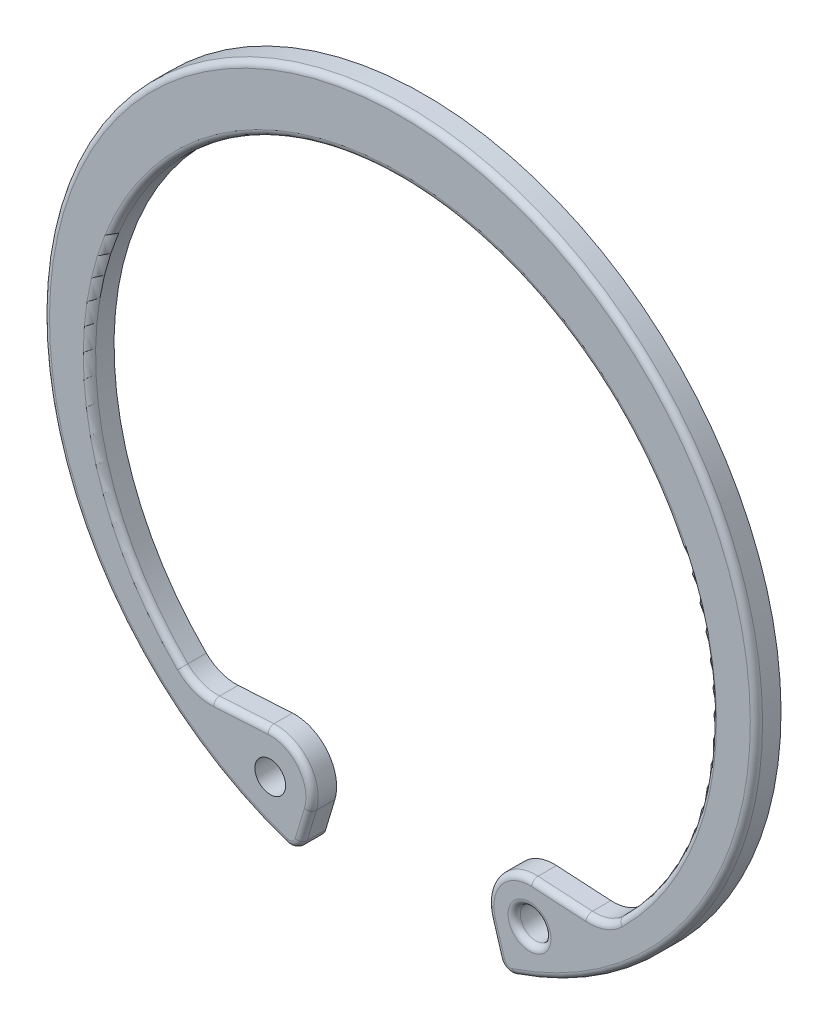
ISO-10303-21;
HEADER;
FILE_DESCRIPTION(('STEP AP214'),'2;1');
FILE_NAME('part.step','',(''),(''),'','','');
FILE_SCHEMA(('AUTOMOTIVE_DESIGN { 1 0 10303 214 1 1 1 1 }'));
ENDSEC;
DATA;
#1=APPLICATION_CONTEXT('core data for automotive mechanical design processes');
#2=APPLICATION_PROTOCOL_DEFINITION('international standard','automotive_design',2000,#1);
#3=PRODUCT_CONTEXT('',#1,'mechanical');
#4=PRODUCT('Part','Part','',(#3));
#5=PRODUCT_RELATED_PRODUCT_CATEGORY('part','',(#4));
#6=PRODUCT_DEFINITION_FORMATION('','',#4);
#7=PRODUCT_DEFINITION_CONTEXT('part definition',#1,'design');
#8=PRODUCT_DEFINITION('design','',#6,#7);
#9=PRODUCT_DEFINITION_SHAPE('','',#8);
#10=(LENGTH_UNIT() NAMED_UNIT(*) SI_UNIT(.MILLI.,.METRE.));
#11=(NAMED_UNIT(*) PLANE_ANGLE_UNIT() SI_UNIT($,.RADIAN.));
#12=(NAMED_UNIT(*) SI_UNIT($,.STERADIAN.) SOLID_ANGLE_UNIT());
#13=UNCERTAINTY_MEASURE_WITH_UNIT(LENGTH_MEASURE(1.E-05),#10,'distance_accuracy_value','');
#14=(GEOMETRIC_REPRESENTATION_CONTEXT(3) GLOBAL_UNCERTAINTY_ASSIGNED_CONTEXT((#13)) GLOBAL_UNIT_ASSIGNED_CONTEXT((#10,
#11,#12)) REPRESENTATION_CONTEXT('',''));
#15=CARTESIAN_POINT('',(0.,0.,0.));
#16=DIRECTION('',(0.,0.,1.));
#17=DIRECTION('',(1.,0.,0.));
#18=AXIS2_PLACEMENT_3D('',#15,#16,#17);
#19=CARTESIAN_POINT('',(0.,0.,2.));
#20=DIRECTION('',(0.,0.,1.));
#21=DIRECTION('',(1.,0.,0.));
#22=AXIS2_PLACEMENT_3D('',#19,#20,#21);
#23=PLANE('',#22);
#24=CARTESIAN_POINT('',(10.5436447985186,-23.3279136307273,2.));
#25=DIRECTION('',(0.,0.,1.));
#26=DIRECTION('',(1.,0.,0.));
#27=AXIS2_PLACEMENT_3D('',#24,#25,#26);
#28=CIRCLE('',#27,1.75);
#29=CARTESIAN_POINT('',(12.2936447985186,-23.3279136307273,2.));
#30=VERTEX_POINT('',#29);
#31=EDGE_CURVE('E253',#30,#30,#28,.F.);
#32=ORIENTED_EDGE('',*,*,#31,.T.);
#33=EDGE_LOOP('',(#32));
#34=FACE_BOUND('',#33,.T.);
#35=DIRECTION('',(0.287187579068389,-0.957874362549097,0.));
#36=VECTOR('',#35,1.);
#37=CARTESIAN_POINT('',(8.5150594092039,-26.6597780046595,2.));
#38=LINE('',#37,#36);
#39=CARTESIAN_POINT('',(7.76580914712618,-24.1607576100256,2.));
#40=VERTEX_POINT('',#39);
#41=CARTESIAN_POINT('',(8.5150594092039,-26.6597780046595,2.));
#42=VERTEX_POINT('',#41);
#43=EDGE_CURVE('E248',#40,#42,#38,.T.);
#44=ORIENTED_EDGE('',*,*,#43,.T.);
#45=CARTESIAN_POINT('',(8.99399659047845,-26.5161842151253,2.));
#46=DIRECTION('',(0.,0.,1.));
#47=DIRECTION('',(1.,0.,0.));
#48=AXIS2_PLACEMENT_3D('',#45,#46,#47);
#49=CIRCLE('',#48,0.5);
#50=CARTESIAN_POINT('',(9.15460367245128,-26.9896875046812,2.));
#51=VERTEX_POINT('',#50);
#52=EDGE_CURVE('E250',#42,#51,#49,.T.);
#53=ORIENTED_EDGE('',*,*,#52,.T.);
#54=CARTESIAN_POINT('',(0.,0.,2.));
#55=DIRECTION('',(0.,0.,1.));
#56=DIRECTION('',(1.,0.,0.));
#57=AXIS2_PLACEMENT_3D('',#54,#55,#56);
#58=CIRCLE('',#57,28.5);
#59=CARTESIAN_POINT('',(-9.15460367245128,-26.9896875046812,2.));
#60=VERTEX_POINT('',#59);
#61=EDGE_CURVE('E228',#51,#60,#58,.T.);
#62=ORIENTED_EDGE('',*,*,#61,.T.);
#63=CARTESIAN_POINT('',(-8.99399659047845,-26.5161842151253,2.));
#64=DIRECTION('',(0.,0.,1.));
#65=DIRECTION('',(1.,0.,0.));
#66=AXIS2_PLACEMENT_3D('',#63,#64,#65);
#67=CIRCLE('',#66,0.5);
#68=CARTESIAN_POINT('',(-8.5150594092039,-26.6597780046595,2.));
#69=VERTEX_POINT('',#68);
#70=EDGE_CURVE('E230',#60,#69,#67,.T.);
#71=ORIENTED_EDGE('',*,*,#70,.T.);
#72=DIRECTION('',(0.287187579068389,0.957874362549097,0.));
#73=VECTOR('',#72,1.);
#74=CARTESIAN_POINT('',(-7.76580914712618,-24.1607576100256,2.));
#75=LINE('',#74,#73);
#76=CARTESIAN_POINT('',(-7.76580914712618,-24.1607576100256,2.));
#77=VERTEX_POINT('',#76);
#78=EDGE_CURVE('E232',#69,#77,#75,.T.);
#79=ORIENTED_EDGE('',*,*,#78,.T.);
#80=CARTESIAN_POINT('',(-10.5436447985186,-23.3279136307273,2.));
#81=DIRECTION('',(0.,0.,1.));
#82=DIRECTION('',(1.,0.,0.));
#83=AXIS2_PLACEMENT_3D('',#80,#81,#82);
#84=CIRCLE('',#83,2.9);
#85=CARTESIAN_POINT('',(-10.7111032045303,-20.4327525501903,2.));
#86=VERTEX_POINT('',#85);
#87=EDGE_CURVE('E234',#77,#86,#84,.T.);
#88=ORIENTED_EDGE('',*,*,#87,.T.);
#89=DIRECTION('',(-0.998331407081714,-0.0577442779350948,0.));
#90=VECTOR('',#89,1.);
#91=CARTESIAN_POINT('',(-15.1299326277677,-20.6883411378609,2.));
#92=LINE('',#91,#90);
#93=CARTESIAN_POINT('',(-15.1299326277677,-20.6883411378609,2.));
#94=VERTEX_POINT('',#93);
#95=EDGE_CURVE('E236',#86,#94,#92,.T.);
#96=ORIENTED_EDGE('',*,*,#95,.T.);
#97=CARTESIAN_POINT('',(-15.3551353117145,-16.7948486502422,2.));
#98=DIRECTION('',(0.,0.,1.));
#99=DIRECTION('',(1.,0.,0.));
#100=AXIS2_PLACEMENT_3D('',#97,#98,#99);
#101=CIRCLE('',#100,3.89999999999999);
#102=CARTESIAN_POINT('',(-18.0958688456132,-19.5694440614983,2.));
#103=VERTEX_POINT('',#102);
#104=EDGE_CURVE('E238',#94,#103,#101,.F.);
#105=ORIENTED_EDGE('',*,*,#104,.T.);
#106=CARTESIAN_POINT('',(0.,-1.25,2.));
#107=DIRECTION('',(0.,0.,1.));
#108=DIRECTION('',(1.,0.,0.));
#109=AXIS2_PLACEMENT_3D('',#106,#107,#108);
#110=CIRCLE('',#109,25.75);
#111=CARTESIAN_POINT('',(18.0958688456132,-19.5694440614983,2.));
#112=VERTEX_POINT('',#111);
#113=EDGE_CURVE('E240',#103,#112,#110,.F.);
#114=ORIENTED_EDGE('',*,*,#113,.T.);
#115=CARTESIAN_POINT('',(15.3551353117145,-16.7948486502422,2.));
#116=DIRECTION('',(0.,0.,1.));
#117=DIRECTION('',(1.,0.,0.));
#118=AXIS2_PLACEMENT_3D('',#115,#116,#117);
#119=CIRCLE('',#118,3.89999999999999);
#120=CARTESIAN_POINT('',(15.1299326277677,-20.6883411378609,2.));
#121=VERTEX_POINT('',#120);
#122=EDGE_CURVE('E242',#112,#121,#119,.F.);
#123=ORIENTED_EDGE('',*,*,#122,.T.);
#124=DIRECTION('',(-0.998331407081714,0.0577442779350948,0.));
#125=VECTOR('',#124,1.);
#126=CARTESIAN_POINT('',(10.7111032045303,-20.4327525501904,2.));
#127=LINE('',#126,#125);
#128=CARTESIAN_POINT('',(10.7111032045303,-20.4327525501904,2.));
#129=VERTEX_POINT('',#128);
#130=EDGE_CURVE('E244',#121,#129,#127,.T.);
#131=ORIENTED_EDGE('',*,*,#130,.T.);
#132=CARTESIAN_POINT('',(10.5436447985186,-23.3279136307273,2.));
#133=DIRECTION('',(0.,0.,1.));
#134=DIRECTION('',(1.,0.,0.));
#135=AXIS2_PLACEMENT_3D('',#132,#133,#134);
#136=CIRCLE('',#135,2.9);
#137=EDGE_CURVE('E246',#129,#40,#136,.T.);
#138=ORIENTED_EDGE('',*,*,#137,.T.);
#139=EDGE_LOOP('',(#44,#53,#62,#71,#79,#88,#96,#105,#114,#123,#131,#138));
#140=FACE_BOUND('',#139,.T.);
#141=CARTESIAN_POINT('',(-10.5436447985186,-23.3279136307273,2.));
#142=DIRECTION('',(0.,0.,1.));
#143=DIRECTION('',(-1.,0.,0.));
#144=AXIS2_PLACEMENT_3D('',#141,#142,#143);
#145=CIRCLE('',#144,1.25);
#146=CARTESIAN_POINT('',(-11.7936447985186,-23.3279136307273,2.));
#147=VERTEX_POINT('',#146);
#148=EDGE_CURVE('E390',#147,#147,#145,.T.);
#149=ORIENTED_EDGE('',*,*,#148,.F.);
#150=EDGE_LOOP('',(#149));
#151=FACE_BOUND('',#150,.T.);
#152=ADVANCED_FACE('F30',(#34,#140,#151),#23,.T.);
#153=CARTESIAN_POINT('',(0.,0.,0.));
#154=DIRECTION('',(0.,0.,1.));
#155=DIRECTION('',(1.,0.,0.));
#156=AXIS2_PLACEMENT_3D('',#153,#154,#155);
#157=PLANE('',#156);
#158=CARTESIAN_POINT('',(10.5436447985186,-23.3279136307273,0.));
#159=DIRECTION('',(0.,0.,1.));
#160=DIRECTION('',(1.,0.,0.));
#161=AXIS2_PLACEMENT_3D('',#158,#159,#160);
#162=CIRCLE('',#161,1.25);
#163=CARTESIAN_POINT('',(11.7936447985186,-23.3279136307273,0.));
#164=VERTEX_POINT('',#163);
#165=EDGE_CURVE('E393',#164,#164,#162,.T.);
#166=ORIENTED_EDGE('',*,*,#165,.T.);
#167=EDGE_LOOP('',(#166));
#168=FACE_BOUND('',#167,.T.);
#169=CARTESIAN_POINT('',(0.,0.,0.));
#170=DIRECTION('',(0.,0.,1.));
#171=DIRECTION('',(1.,0.,0.));
#172=AXIS2_PLACEMENT_3D('',#169,#170,#171);
#173=CIRCLE('',#172,29.);
#174=CARTESIAN_POINT('',(9.31521075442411,-27.463190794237,0.));
#175=VERTEX_POINT('',#174);
#176=CARTESIAN_POINT('',(-9.31521075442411,-27.463190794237,0.));
#177=VERTEX_POINT('',#176);
#178=EDGE_CURVE('E174',#175,#177,#173,.T.);
#179=ORIENTED_EDGE('',*,*,#178,.F.);
#180=CARTESIAN_POINT('',(8.99399659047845,-26.5161842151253,0.));
#181=DIRECTION('',(0.,0.,1.));
#182=DIRECTION('',(1.,0.,0.));
#183=AXIS2_PLACEMENT_3D('',#180,#181,#182);
#184=CIRCLE('',#183,1.);
#185=CARTESIAN_POINT('',(8.03612222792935,-26.8033717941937,0.));
#186=VERTEX_POINT('',#185);
#187=EDGE_CURVE('E222',#175,#186,#184,.F.);
#188=ORIENTED_EDGE('',*,*,#187,.T.);
#189=DIRECTION('',(0.287187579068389,-0.957874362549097,0.));
#190=VECTOR('',#189,1.);
#191=CARTESIAN_POINT('',(7.28687196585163,-24.3043513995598,0.));
#192=LINE('',#191,#190);
#193=CARTESIAN_POINT('',(7.28687196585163,-24.3043513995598,0.));
#194=VERTEX_POINT('',#193);
#195=EDGE_CURVE('E201',#194,#186,#192,.T.);
#196=ORIENTED_EDGE('',*,*,#195,.F.);
#197=CARTESIAN_POINT('',(10.5436447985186,-23.3279136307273,0.));
#198=DIRECTION('',(0.,0.,1.));
#199=DIRECTION('',(1.,0.,0.));
#200=AXIS2_PLACEMENT_3D('',#197,#198,#199);
#201=CIRCLE('',#200,3.4);
#202=CARTESIAN_POINT('',(10.7399753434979,-19.9335868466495,0.));
#203=VERTEX_POINT('',#202);
#204=EDGE_CURVE('E198',#203,#194,#201,.T.);
#205=ORIENTED_EDGE('',*,*,#204,.F.);
#206=DIRECTION('',(-0.998331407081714,0.0577442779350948,0.));
#207=VECTOR('',#206,1.);
#208=CARTESIAN_POINT('',(15.1588047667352,-20.1891754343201,0.));
#209=LINE('',#208,#207);
#210=CARTESIAN_POINT('',(15.1588047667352,-20.1891754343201,0.));
#211=VERTEX_POINT('',#210);
#212=EDGE_CURVE('E195',#211,#203,#209,.T.);
#213=ORIENTED_EDGE('',*,*,#212,.F.);
#214=CARTESIAN_POINT('',(15.3551353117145,-16.7948486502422,0.));
#215=DIRECTION('',(0.,0.,-1.));
#216=DIRECTION('',(1.,0.,0.));
#217=AXIS2_PLACEMENT_3D('',#214,#215,#216);
#218=CIRCLE('',#217,3.39999999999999);
#219=CARTESIAN_POINT('',(17.7444927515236,-19.2137267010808,0.));
#220=VERTEX_POINT('',#219);
#221=EDGE_CURVE('E192',#220,#211,#218,.T.);
#222=ORIENTED_EDGE('',*,*,#221,.F.);
#223=CARTESIAN_POINT('',(0.,-1.25,0.));
#224=DIRECTION('',(0.,0.,-1.));
#225=DIRECTION('',(1.,0.,0.));
#226=AXIS2_PLACEMENT_3D('',#223,#224,#225);
#227=CIRCLE('',#226,25.25);
#228=CARTESIAN_POINT('',(-17.7444927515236,-19.2137267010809,0.));
#229=VERTEX_POINT('',#228);
#230=EDGE_CURVE('E189',#229,#220,#227,.T.);
#231=ORIENTED_EDGE('',*,*,#230,.F.);
#232=CARTESIAN_POINT('',(-15.3551353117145,-16.7948486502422,0.));
#233=DIRECTION('',(0.,0.,-1.));
#234=DIRECTION('',(-1.,0.,0.));
#235=AXIS2_PLACEMENT_3D('',#232,#233,#234);
#236=CIRCLE('',#235,3.39999999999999);
#237=CARTESIAN_POINT('',(-15.1588047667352,-20.1891754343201,0.));
#238=VERTEX_POINT('',#237);
#239=EDGE_CURVE('E183',#238,#229,#236,.T.);
#240=ORIENTED_EDGE('',*,*,#239,.F.);
#241=DIRECTION('',(-0.998331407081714,-0.0577442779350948,0.));
#242=VECTOR('',#241,1.);
#243=CARTESIAN_POINT('',(-15.1588047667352,-20.1891754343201,0.));
#244=LINE('',#243,#242);
#245=CARTESIAN_POINT('',(-10.7399753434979,-19.9335868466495,0.));
#246=VERTEX_POINT('',#245);
#247=EDGE_CURVE('E181',#246,#238,#244,.T.);
#248=ORIENTED_EDGE('',*,*,#247,.F.);
#249=CARTESIAN_POINT('',(-10.5436447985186,-23.3279136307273,0.));
#250=DIRECTION('',(0.,0.,1.));
#251=DIRECTION('',(-1.,0.,0.));
#252=AXIS2_PLACEMENT_3D('',#249,#250,#251);
#253=CIRCLE('',#252,3.4);
#254=CARTESIAN_POINT('',(-7.28687196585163,-24.3043513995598,0.));
#255=VERTEX_POINT('',#254);
#256=EDGE_CURVE('E160',#255,#246,#253,.T.);
#257=ORIENTED_EDGE('',*,*,#256,.F.);
#258=DIRECTION('',(0.287187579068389,0.957874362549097,0.));
#259=VECTOR('',#258,1.);
#260=CARTESIAN_POINT('',(-7.28687196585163,-24.3043513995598,0.));
#261=LINE('',#260,#259);
#262=CARTESIAN_POINT('',(-8.03612222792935,-26.8033717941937,0.));
#263=VERTEX_POINT('',#262);
#264=EDGE_CURVE('E169',#263,#255,#261,.T.);
#265=ORIENTED_EDGE('',*,*,#264,.F.);
#266=CARTESIAN_POINT('',(-8.99399659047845,-26.5161842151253,0.));
#267=DIRECTION('',(0.,0.,1.));
#268=DIRECTION('',(1.,0.,0.));
#269=AXIS2_PLACEMENT_3D('',#266,#267,#268);
#270=CIRCLE('',#269,1.);
#271=EDGE_CURVE('E220',#263,#177,#270,.F.);
#272=ORIENTED_EDGE('',*,*,#271,.T.);
#273=EDGE_LOOP('',(#179,#188,#196,#205,#213,#222,#231,#240,#248,#257,#265,#272));
#274=FACE_BOUND('',#273,.T.);
#275=CARTESIAN_POINT('',(-10.5436447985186,-23.3279136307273,0.));
#276=DIRECTION('',(0.,0.,1.));
#277=DIRECTION('',(-1.,0.,0.));
#278=AXIS2_PLACEMENT_3D('',#275,#276,#277);
#279=CIRCLE('',#278,1.25);
#280=CARTESIAN_POINT('',(-11.7936447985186,-23.3279136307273,0.));
#281=VERTEX_POINT('',#280);
#282=EDGE_CURVE('E387',#281,#281,#279,.T.);
#283=ORIENTED_EDGE('',*,*,#282,.T.);
#284=EDGE_LOOP('',(#283));
#285=FACE_BOUND('',#284,.T.);
#286=ADVANCED_FACE('F177',(#168,#274,#285),#157,.F.);
#287=CARTESIAN_POINT('',(0.,0.,2.));
#288=DIRECTION('',(0.,0.,-1.));
#289=DIRECTION('',(-1.,0.,0.));
#290=AXIS2_PLACEMENT_3D('',#287,#288,#289);
#291=CYLINDRICAL_SURFACE('',#290,29.);
#292=DIRECTION('',(0.,0.,-1.));
#293=VECTOR('',#292,1.);
#294=CARTESIAN_POINT('',(-9.31521075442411,-27.463190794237,2.));
#295=LINE('',#294,#293);
#296=CARTESIAN_POINT('',(-9.31521075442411,-27.463190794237,1.5));
#297=VERTEX_POINT('',#296);
#298=EDGE_CURVE('E165',#177,#297,#295,.F.);
#299=ORIENTED_EDGE('',*,*,#298,.T.);
#300=CARTESIAN_POINT('',(0.,0.,1.5));
#301=DIRECTION('',(0.,0.,1.));
#302=DIRECTION('',(1.,0.,0.));
#303=AXIS2_PLACEMENT_3D('',#300,#301,#302);
#304=CIRCLE('',#303,29.);
#305=CARTESIAN_POINT('',(9.31521075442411,-27.463190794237,1.5));
#306=VERTEX_POINT('',#305);
#307=EDGE_CURVE('E11',#297,#306,#304,.F.);
#308=ORIENTED_EDGE('',*,*,#307,.T.);
#309=DIRECTION('',(0.,0.,-1.));
#310=VECTOR('',#309,1.);
#311=CARTESIAN_POINT('',(9.31521075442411,-27.463190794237,2.));
#312=LINE('',#311,#310);
#313=EDGE_CURVE('E218',#306,#175,#312,.T.);
#314=ORIENTED_EDGE('',*,*,#313,.T.);
#315=ORIENTED_EDGE('',*,*,#178,.T.);
#316=EDGE_LOOP('',(#299,#308,#314,#315));
#317=FACE_BOUND('',#316,.T.);
#318=ADVANCED_FACE('F32',(#317),#291,.T.);
#319=CARTESIAN_POINT('',(-7.28687196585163,-24.3043513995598,2.));
#320=DIRECTION('',(-0.957874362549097,0.287187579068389,0.));
#321=DIRECTION('',(-0.287187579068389,-0.957874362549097,0.));
#322=AXIS2_PLACEMENT_3D('',#319,#320,#321);
#323=PLANE('',#322);
#324=DIRECTION('',(0.,0.,-1.));
#325=VECTOR('',#324,1.);
#326=CARTESIAN_POINT('',(-7.28687196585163,-24.3043513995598,2.));
#327=LINE('',#326,#325);
#328=CARTESIAN_POINT('',(-7.28687196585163,-24.3043513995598,1.5));
#329=VERTEX_POINT('',#328);
#330=EDGE_CURVE('E155',#329,#255,#327,.T.);
#331=ORIENTED_EDGE('',*,*,#330,.F.);
#332=DIRECTION('',(0.287187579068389,0.957874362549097,0.));
#333=VECTOR('',#332,1.);
#334=CARTESIAN_POINT('',(-8.03612222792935,-26.8033717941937,1.5));
#335=LINE('',#334,#333);
#336=CARTESIAN_POINT('',(-8.03612222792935,-26.8033717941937,1.5));
#337=VERTEX_POINT('',#336);
#338=EDGE_CURVE('E53',#329,#337,#335,.F.);
#339=ORIENTED_EDGE('',*,*,#338,.T.);
#340=DIRECTION('',(0.,0.,-1.));
#341=VECTOR('',#340,1.);
#342=CARTESIAN_POINT('',(-8.03612222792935,-26.8033717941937,2.));
#343=LINE('',#342,#341);
#344=EDGE_CURVE('E171',#337,#263,#343,.T.);
#345=ORIENTED_EDGE('',*,*,#344,.T.);
#346=ORIENTED_EDGE('',*,*,#264,.T.);
#347=EDGE_LOOP('',(#331,#339,#345,#346));
#348=FACE_BOUND('',#347,.T.);
#349=ADVANCED_FACE('F170',(#348),#323,.F.);
#350=CARTESIAN_POINT('',(-10.5436447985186,-23.3279136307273,2.));
#351=DIRECTION('',(0.,0.,-1.));
#352=DIRECTION('',(-1.,0.,0.));
#353=AXIS2_PLACEMENT_3D('',#350,#351,#352);
#354=CYLINDRICAL_SURFACE('',#353,3.4);
#355=DIRECTION('',(0.,0.,-1.));
#356=VECTOR('',#355,1.);
#357=CARTESIAN_POINT('',(-10.7399753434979,-19.9335868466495,2.));
#358=LINE('',#357,#356);
#359=CARTESIAN_POINT('',(-10.7399753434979,-19.9335868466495,1.5));
#360=VERTEX_POINT('',#359);
#361=EDGE_CURVE('E166',#360,#246,#358,.T.);
#362=ORIENTED_EDGE('',*,*,#361,.F.);
#363=CARTESIAN_POINT('',(-10.5436447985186,-23.3279136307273,1.5));
#364=DIRECTION('',(0.,0.,1.));
#365=DIRECTION('',(1.,0.,0.));
#366=AXIS2_PLACEMENT_3D('',#363,#364,#365);
#367=CIRCLE('',#366,3.4);
#368=EDGE_CURVE('E163',#360,#329,#367,.F.);
#369=ORIENTED_EDGE('',*,*,#368,.T.);
#370=ORIENTED_EDGE('',*,*,#330,.T.);
#371=ORIENTED_EDGE('',*,*,#256,.T.);
#372=EDGE_LOOP('',(#362,#369,#370,#371));
#373=FACE_BOUND('',#372,.T.);
#374=ADVANCED_FACE('F158',(#373),#354,.T.);
#375=CARTESIAN_POINT('',(-15.1588047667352,-20.1891754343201,2.));
#376=DIRECTION('',(0.0577442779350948,-0.998331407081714,0.));
#377=DIRECTION('',(0.998331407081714,0.0577442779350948,0.));
#378=AXIS2_PLACEMENT_3D('',#375,#376,#377);
#379=PLANE('',#378);
#380=DIRECTION('',(0.,0.,-1.));
#381=VECTOR('',#380,1.);
#382=CARTESIAN_POINT('',(-15.1588047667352,-20.1891754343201,2.));
#383=LINE('',#382,#381);
#384=CARTESIAN_POINT('',(-15.1588047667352,-20.1891754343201,1.5));
#385=VERTEX_POINT('',#384);
#386=EDGE_CURVE('E214',#385,#238,#383,.T.);
#387=ORIENTED_EDGE('',*,*,#386,.F.);
#388=DIRECTION('',(-0.998331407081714,-0.0577442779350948,0.));
#389=VECTOR('',#388,1.);
#390=CARTESIAN_POINT('',(-10.7399753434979,-19.9335868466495,1.5));
#391=LINE('',#390,#389);
#392=EDGE_CURVE('E271',#385,#360,#391,.F.);
#393=ORIENTED_EDGE('',*,*,#392,.T.);
#394=ORIENTED_EDGE('',*,*,#361,.T.);
#395=ORIENTED_EDGE('',*,*,#247,.T.);
#396=EDGE_LOOP('',(#387,#393,#394,#395));
#397=FACE_BOUND('',#396,.T.);
#398=ADVANCED_FACE('F327',(#397),#379,.F.);
#399=CARTESIAN_POINT('',(-15.3551353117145,-16.7948486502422,2.));
#400=DIRECTION('',(0.,0.,-1.));
#401=DIRECTION('',(-1.,0.,0.));
#402=AXIS2_PLACEMENT_3D('',#399,#400,#401);
#403=CYLINDRICAL_SURFACE('',#402,3.39999999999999);
#404=DIRECTION('',(0.,0.,-1.));
#405=VECTOR('',#404,1.);
#406=CARTESIAN_POINT('',(-17.7444927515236,-19.2137267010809,2.));
#407=LINE('',#406,#405);
#408=CARTESIAN_POINT('',(-17.7444927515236,-19.2137267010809,1.5));
#409=VERTEX_POINT('',#408);
#410=EDGE_CURVE('E212',#409,#229,#407,.T.);
#411=ORIENTED_EDGE('',*,*,#410,.F.);
#412=CARTESIAN_POINT('',(-15.3551353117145,-16.7948486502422,1.5));
#413=DIRECTION('',(0.,0.,1.));
#414=DIRECTION('',(1.,0.,0.));
#415=AXIS2_PLACEMENT_3D('',#412,#413,#414);
#416=CIRCLE('',#415,3.39999999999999);
#417=EDGE_CURVE('E269',#409,#385,#416,.T.);
#418=ORIENTED_EDGE('',*,*,#417,.T.);
#419=ORIENTED_EDGE('',*,*,#386,.T.);
#420=ORIENTED_EDGE('',*,*,#239,.T.);
#421=EDGE_LOOP('',(#411,#418,#419,#420));
#422=FACE_BOUND('',#421,.T.);
#423=ADVANCED_FACE('F323',(#422),#403,.F.);
#424=CARTESIAN_POINT('',(0.,-1.25,2.));
#425=DIRECTION('',(0.,0.,-1.));
#426=DIRECTION('',(-1.,0.,0.));
#427=AXIS2_PLACEMENT_3D('',#424,#425,#426);
#428=CYLINDRICAL_SURFACE('',#427,25.25);
#429=DIRECTION('',(0.,0.,-1.));
#430=VECTOR('',#429,1.);
#431=CARTESIAN_POINT('',(17.7444927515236,-19.2137267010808,2.));
#432=LINE('',#431,#430);
#433=CARTESIAN_POINT('',(17.7444927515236,-19.2137267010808,1.5));
#434=VERTEX_POINT('',#433);
#435=EDGE_CURVE('E210',#434,#220,#432,.T.);
#436=ORIENTED_EDGE('',*,*,#435,.F.);
#437=CARTESIAN_POINT('',(0.,-1.25,1.5));
#438=DIRECTION('',(0.,0.,1.));
#439=DIRECTION('',(1.,0.,0.));
#440=AXIS2_PLACEMENT_3D('',#437,#438,#439);
#441=CIRCLE('',#440,25.25);
#442=EDGE_CURVE('E267',#434,#409,#441,.T.);
#443=ORIENTED_EDGE('',*,*,#442,.T.);
#444=ORIENTED_EDGE('',*,*,#410,.T.);
#445=ORIENTED_EDGE('',*,*,#230,.T.);
#446=EDGE_LOOP('',(#436,#443,#444,#445));
#447=FACE_BOUND('',#446,.T.);
#448=ADVANCED_FACE('F319',(#447),#428,.F.);
#449=CARTESIAN_POINT('',(15.3551353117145,-16.7948486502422,2.));
#450=DIRECTION('',(0.,0.,-1.));
#451=DIRECTION('',(-1.,0.,0.));
#452=AXIS2_PLACEMENT_3D('',#449,#450,#451);
#453=CYLINDRICAL_SURFACE('',#452,3.39999999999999);
#454=DIRECTION('',(0.,0.,-1.));
#455=VECTOR('',#454,1.);
#456=CARTESIAN_POINT('',(15.1588047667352,-20.1891754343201,2.));
#457=LINE('',#456,#455);
#458=CARTESIAN_POINT('',(15.1588047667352,-20.1891754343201,1.5));
#459=VERTEX_POINT('',#458);
#460=EDGE_CURVE('E208',#459,#211,#457,.T.);
#461=ORIENTED_EDGE('',*,*,#460,.F.);
#462=CARTESIAN_POINT('',(15.3551353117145,-16.7948486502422,1.5));
#463=DIRECTION('',(0.,0.,1.));
#464=DIRECTION('',(1.,0.,0.));
#465=AXIS2_PLACEMENT_3D('',#462,#463,#464);
#466=CIRCLE('',#465,3.39999999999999);
#467=EDGE_CURVE('E265',#459,#434,#466,.T.);
#468=ORIENTED_EDGE('',*,*,#467,.T.);
#469=ORIENTED_EDGE('',*,*,#435,.T.);
#470=ORIENTED_EDGE('',*,*,#221,.T.);
#471=EDGE_LOOP('',(#461,#468,#469,#470));
#472=FACE_BOUND('',#471,.T.);
#473=ADVANCED_FACE('F315',(#472),#453,.F.);
#474=CARTESIAN_POINT('',(15.1588047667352,-20.1891754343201,2.));
#475=DIRECTION('',(-0.0577442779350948,-0.998331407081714,0.));
#476=DIRECTION('',(0.998331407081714,-0.0577442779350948,0.));
#477=AXIS2_PLACEMENT_3D('',#474,#475,#476);
#478=PLANE('',#477);
#479=DIRECTION('',(0.,0.,-1.));
#480=VECTOR('',#479,1.);
#481=CARTESIAN_POINT('',(10.7399753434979,-19.9335868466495,2.));
#482=LINE('',#481,#480);
#483=CARTESIAN_POINT('',(10.7399753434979,-19.9335868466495,1.5));
#484=VERTEX_POINT('',#483);
#485=EDGE_CURVE('E206',#484,#203,#482,.T.);
#486=ORIENTED_EDGE('',*,*,#485,.F.);
#487=DIRECTION('',(-0.998331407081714,0.0577442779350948,0.));
#488=VECTOR('',#487,1.);
#489=CARTESIAN_POINT('',(15.1588047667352,-20.1891754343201,1.5));
#490=LINE('',#489,#488);
#491=EDGE_CURVE('E263',#484,#459,#490,.F.);
#492=ORIENTED_EDGE('',*,*,#491,.T.);
#493=ORIENTED_EDGE('',*,*,#460,.T.);
#494=ORIENTED_EDGE('',*,*,#212,.T.);
#495=EDGE_LOOP('',(#486,#492,#493,#494));
#496=FACE_BOUND('',#495,.T.);
#497=ADVANCED_FACE('F311',(#496),#478,.F.);
#498=CARTESIAN_POINT('',(10.5436447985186,-23.3279136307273,2.));
#499=DIRECTION('',(0.,0.,-1.));
#500=DIRECTION('',(-1.,0.,0.));
#501=AXIS2_PLACEMENT_3D('',#498,#499,#500);
#502=CYLINDRICAL_SURFACE('',#501,3.4);
#503=DIRECTION('',(0.,0.,-1.));
#504=VECTOR('',#503,1.);
#505=CARTESIAN_POINT('',(7.28687196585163,-24.3043513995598,2.));
#506=LINE('',#505,#504);
#507=CARTESIAN_POINT('',(7.28687196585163,-24.3043513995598,1.5));
#508=VERTEX_POINT('',#507);
#509=EDGE_CURVE('E204',#508,#194,#506,.T.);
#510=ORIENTED_EDGE('',*,*,#509,.F.);
#511=CARTESIAN_POINT('',(10.5436447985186,-23.3279136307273,1.5));
#512=DIRECTION('',(0.,0.,1.));
#513=DIRECTION('',(1.,0.,0.));
#514=AXIS2_PLACEMENT_3D('',#511,#512,#513);
#515=CIRCLE('',#514,3.4);
#516=EDGE_CURVE('E261',#508,#484,#515,.F.);
#517=ORIENTED_EDGE('',*,*,#516,.T.);
#518=ORIENTED_EDGE('',*,*,#485,.T.);
#519=ORIENTED_EDGE('',*,*,#204,.T.);
#520=EDGE_LOOP('',(#510,#517,#518,#519));
#521=FACE_BOUND('',#520,.T.);
#522=ADVANCED_FACE('F307',(#521),#502,.T.);
#523=CARTESIAN_POINT('',(7.28687196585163,-24.3043513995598,2.));
#524=DIRECTION('',(0.957874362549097,0.287187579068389,0.));
#525=DIRECTION('',(-0.287187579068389,0.957874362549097,0.));
#526=AXIS2_PLACEMENT_3D('',#523,#524,#525);
#527=PLANE('',#526);
#528=DIRECTION('',(0.,0.,-1.));
#529=VECTOR('',#528,1.);
#530=CARTESIAN_POINT('',(8.03612222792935,-26.8033717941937,2.));
#531=LINE('',#530,#529);
#532=CARTESIAN_POINT('',(8.03612222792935,-26.8033717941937,1.5));
#533=VERTEX_POINT('',#532);
#534=EDGE_CURVE('E224',#186,#533,#531,.F.);
#535=ORIENTED_EDGE('',*,*,#534,.T.);
#536=DIRECTION('',(0.287187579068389,-0.957874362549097,0.));
#537=VECTOR('',#536,1.);
#538=CARTESIAN_POINT('',(7.28687196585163,-24.3043513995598,1.5));
#539=LINE('',#538,#537);
#540=EDGE_CURVE('E259',#533,#508,#539,.F.);
#541=ORIENTED_EDGE('',*,*,#540,.T.);
#542=ORIENTED_EDGE('',*,*,#509,.T.);
#543=ORIENTED_EDGE('',*,*,#195,.T.);
#544=EDGE_LOOP('',(#535,#541,#542,#543));
#545=FACE_BOUND('',#544,.T.);
#546=ADVANCED_FACE('F304',(#545),#527,.F.);
#547=CARTESIAN_POINT('',(10.5436447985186,-23.3279136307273,2.));
#548=DIRECTION('',(0.,0.,-1.));
#549=DIRECTION('',(-1.,0.,0.));
#550=AXIS2_PLACEMENT_3D('',#547,#548,#549);
#551=CYLINDRICAL_SURFACE('',#550,1.25);
#552=CARTESIAN_POINT('',(10.5436447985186,-23.3279136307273,1.5));
#553=DIRECTION('',(0.,0.,1.));
#554=DIRECTION('',(1.,0.,0.));
#555=AXIS2_PLACEMENT_3D('',#552,#553,#554);
#556=CIRCLE('',#555,1.25);
#557=CARTESIAN_POINT('',(11.7936447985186,-23.3279136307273,1.5));
#558=VERTEX_POINT('',#557);
#559=EDGE_CURVE('E38',#558,#558,#556,.T.);
#560=ORIENTED_EDGE('',*,*,#559,.T.);
#561=EDGE_LOOP('',(#560));
#562=FACE_BOUND('',#561,.T.);
#563=ORIENTED_EDGE('',*,*,#165,.F.);
#564=EDGE_LOOP('',(#563));
#565=FACE_BOUND('',#564,.T.);
#566=ADVANCED_FACE('F278',(#562,#565),#551,.F.);
#567=CARTESIAN_POINT('',(-10.5436447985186,-23.3279136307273,2.));
#568=DIRECTION('',(0.,0.,-1.));
#569=DIRECTION('',(-1.,0.,0.));
#570=AXIS2_PLACEMENT_3D('',#567,#568,#569);
#571=CYLINDRICAL_SURFACE('',#570,1.25);
#572=ORIENTED_EDGE('',*,*,#148,.T.);
#573=EDGE_LOOP('',(#572));
#574=FACE_BOUND('',#573,.T.);
#575=ORIENTED_EDGE('',*,*,#282,.F.);
#576=EDGE_LOOP('',(#575));
#577=FACE_BOUND('',#576,.T.);
#578=ADVANCED_FACE('F397',(#574,#577),#571,.F.);
#579=CARTESIAN_POINT('',(8.99399659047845,-26.5161842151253,2.));
#580=DIRECTION('',(0.,0.,-1.));
#581=DIRECTION('',(-1.,0.,0.));
#582=AXIS2_PLACEMENT_3D('',#579,#580,#581);
#583=CYLINDRICAL_SURFACE('',#582,1.);
#584=ORIENTED_EDGE('',*,*,#313,.F.);
#585=CARTESIAN_POINT('',(8.99399659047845,-26.5161842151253,1.5));
#586=DIRECTION('',(0.,0.,1.));
#587=DIRECTION('',(1.,0.,0.));
#588=AXIS2_PLACEMENT_3D('',#585,#586,#587);
#589=CIRCLE('',#588,1.);
#590=EDGE_CURVE('E256',#306,#533,#589,.F.);
#591=ORIENTED_EDGE('',*,*,#590,.T.);
#592=ORIENTED_EDGE('',*,*,#534,.F.);
#593=ORIENTED_EDGE('',*,*,#187,.F.);
#594=EDGE_LOOP('',(#584,#591,#592,#593));
#595=FACE_BOUND('',#594,.T.);
#596=ADVANCED_FACE('F401',(#595),#583,.T.);
#597=CARTESIAN_POINT('',(-8.99399659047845,-26.5161842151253,2.));
#598=DIRECTION('',(0.,0.,-1.));
#599=DIRECTION('',(-1.,0.,0.));
#600=AXIS2_PLACEMENT_3D('',#597,#598,#599);
#601=CYLINDRICAL_SURFACE('',#600,1.);
#602=ORIENTED_EDGE('',*,*,#344,.F.);
#603=CARTESIAN_POINT('',(-8.99399659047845,-26.5161842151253,1.5));
#604=DIRECTION('',(0.,0.,1.));
#605=DIRECTION('',(1.,0.,0.));
#606=AXIS2_PLACEMENT_3D('',#603,#604,#605);
#607=CIRCLE('',#606,1.);
#608=EDGE_CURVE('E45',#337,#297,#607,.F.);
#609=ORIENTED_EDGE('',*,*,#608,.T.);
#610=ORIENTED_EDGE('',*,*,#298,.F.);
#611=ORIENTED_EDGE('',*,*,#271,.F.);
#612=EDGE_LOOP('',(#602,#609,#610,#611));
#613=FACE_BOUND('',#612,.T.);
#614=ADVANCED_FACE('F407',(#613),#601,.T.);
#615=CARTESIAN_POINT('',(-15.3551353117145,-16.7948486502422,1.5));
#616=DIRECTION('',(0.,0.,1.));
#617=DIRECTION('',(1.,0.,0.));
#618=AXIS2_PLACEMENT_3D('',#615,#616,#617);
#619=TOROIDAL_SURFACE('',#618,3.89999999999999,0.5);
#620=CARTESIAN_POINT('',(-15.1299326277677,-20.6883411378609,1.5));
#621=DIRECTION('',(0.998331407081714,0.0577442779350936,0.));
#622=DIRECTION('',(-0.0577442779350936,0.998331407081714,0.));
#623=AXIS2_PLACEMENT_3D('',#620,#621,#622);
#624=CIRCLE('',#623,0.5);
#625=EDGE_CURVE('E381',#385,#94,#624,.T.);
#626=ORIENTED_EDGE('',*,*,#625,.F.);
#627=ORIENTED_EDGE('',*,*,#417,.F.);
#628=CARTESIAN_POINT('',(-18.0958688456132,-19.5694440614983,1.5));
#629=DIRECTION('',(-0.711434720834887,0.702752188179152,0.));
#630=DIRECTION('',(-0.702752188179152,-0.711434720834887,0.));
#631=AXIS2_PLACEMENT_3D('',#628,#629,#630);
#632=CIRCLE('',#631,0.5);
#633=EDGE_CURVE('E384',#103,#409,#632,.T.);
#634=ORIENTED_EDGE('',*,*,#633,.F.);
#635=ORIENTED_EDGE('',*,*,#104,.F.);
#636=EDGE_LOOP('',(#626,#627,#634,#635));
#637=FACE_BOUND('',#636,.T.);
#638=ADVANCED_FACE('F411',(#637),#619,.T.);
#639=CARTESIAN_POINT('',(0.,-1.25,1.5));
#640=DIRECTION('',(0.,0.,1.));
#641=DIRECTION('',(1.,0.,0.));
#642=AXIS2_PLACEMENT_3D('',#639,#640,#641);
#643=TOROIDAL_SURFACE('',#642,25.75,0.5);
#644=ORIENTED_EDGE('',*,*,#633,.T.);
#645=ORIENTED_EDGE('',*,*,#442,.F.);
#646=CARTESIAN_POINT('',(18.0958688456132,-19.5694440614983,1.5));
#647=DIRECTION('',(-0.711434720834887,-0.702752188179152,0.));
#648=DIRECTION('',(0.702752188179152,-0.711434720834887,0.));
#649=AXIS2_PLACEMENT_3D('',#646,#647,#648);
#650=CIRCLE('',#649,0.5);
#651=EDGE_CURVE('E378',#112,#434,#650,.T.);
#652=ORIENTED_EDGE('',*,*,#651,.F.);
#653=ORIENTED_EDGE('',*,*,#113,.F.);
#654=EDGE_LOOP('',(#644,#645,#652,#653));
#655=FACE_BOUND('',#654,.T.);
#656=ADVANCED_FACE('F414',(#655),#643,.T.);
#657=CARTESIAN_POINT('',(1.14219069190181,-19.7471486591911,1.5));
#658=DIRECTION('',(0.998331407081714,0.0577442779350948,0.));
#659=DIRECTION('',(-0.0577442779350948,0.998331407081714,0.));
#660=AXIS2_PLACEMENT_3D('',#657,#658,#659);
#661=CYLINDRICAL_SURFACE('',#660,0.5);
#662=ORIENTED_EDGE('',*,*,#625,.T.);
#663=ORIENTED_EDGE('',*,*,#95,.F.);
#664=CARTESIAN_POINT('',(-10.7111032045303,-20.4327525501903,1.5));
#665=DIRECTION('',(0.998331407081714,0.0577442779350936,0.));
#666=DIRECTION('',(-0.0577442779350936,0.998331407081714,0.));
#667=AXIS2_PLACEMENT_3D('',#664,#665,#666);
#668=CIRCLE('',#667,0.5);
#669=EDGE_CURVE('E375',#360,#86,#668,.T.);
#670=ORIENTED_EDGE('',*,*,#669,.F.);
#671=ORIENTED_EDGE('',*,*,#392,.F.);
#672=EDGE_LOOP('',(#662,#663,#670,#671));
#673=FACE_BOUND('',#672,.T.);
#674=ADVANCED_FACE('F418',(#673),#661,.T.);
#675=CARTESIAN_POINT('',(15.3551353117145,-16.7948486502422,1.5));
#676=DIRECTION('',(0.,0.,1.));
#677=DIRECTION('',(1.,0.,0.));
#678=AXIS2_PLACEMENT_3D('',#675,#676,#677);
#679=TOROIDAL_SURFACE('',#678,3.89999999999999,0.5);
#680=ORIENTED_EDGE('',*,*,#651,.T.);
#681=ORIENTED_EDGE('',*,*,#467,.F.);
#682=CARTESIAN_POINT('',(15.1299326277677,-20.6883411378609,1.5));
#683=DIRECTION('',(-0.998331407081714,0.0577442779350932,0.));
#684=DIRECTION('',(-0.0577442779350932,-0.998331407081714,0.));
#685=AXIS2_PLACEMENT_3D('',#682,#683,#684);
#686=CIRCLE('',#685,0.5);
#687=EDGE_CURVE('E372',#121,#459,#686,.T.);
#688=ORIENTED_EDGE('',*,*,#687,.F.);
#689=ORIENTED_EDGE('',*,*,#122,.F.);
#690=EDGE_LOOP('',(#680,#681,#688,#689));
#691=FACE_BOUND('',#690,.T.);
#692=ADVANCED_FACE('F422',(#691),#679,.T.);
#693=CARTESIAN_POINT('',(-10.5436447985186,-23.3279136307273,1.5));
#694=DIRECTION('',(0.,0.,1.));
#695=DIRECTION('',(1.,0.,0.));
#696=AXIS2_PLACEMENT_3D('',#693,#694,#695);
#697=TOROIDAL_SURFACE('',#696,2.9,0.5);
#698=ORIENTED_EDGE('',*,*,#669,.T.);
#699=ORIENTED_EDGE('',*,*,#87,.F.);
#700=CARTESIAN_POINT('',(-7.76580914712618,-24.1607576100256,1.5));
#701=DIRECTION('',(-0.287187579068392,-0.957874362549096,0.));
#702=DIRECTION('',(0.957874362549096,-0.287187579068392,0.));
#703=AXIS2_PLACEMENT_3D('',#700,#701,#702);
#704=CIRCLE('',#703,0.5);
#705=EDGE_CURVE('E369',#329,#77,#704,.T.);
#706=ORIENTED_EDGE('',*,*,#705,.F.);
#707=ORIENTED_EDGE('',*,*,#368,.F.);
#708=EDGE_LOOP('',(#698,#699,#706,#707));
#709=FACE_BOUND('',#708,.T.);
#710=ADVANCED_FACE('F426',(#709),#697,.T.);
#711=CARTESIAN_POINT('',(-1.14219069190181,-19.7471486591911,1.5));
#712=DIRECTION('',(0.998331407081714,-0.0577442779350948,0.));
#713=DIRECTION('',(0.0577442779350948,0.998331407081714,0.));
#714=AXIS2_PLACEMENT_3D('',#711,#712,#713);
#715=CYLINDRICAL_SURFACE('',#714,0.5);
#716=ORIENTED_EDGE('',*,*,#687,.T.);
#717=ORIENTED_EDGE('',*,*,#491,.F.);
#718=CARTESIAN_POINT('',(10.7111032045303,-20.4327525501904,1.5));
#719=DIRECTION('',(-0.998331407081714,0.0577442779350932,0.));
#720=DIRECTION('',(-0.0577442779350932,-0.998331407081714,0.));
#721=AXIS2_PLACEMENT_3D('',#718,#719,#720);
#722=CIRCLE('',#721,0.5);
#723=EDGE_CURVE('E366',#129,#484,#722,.T.);
#724=ORIENTED_EDGE('',*,*,#723,.F.);
#725=ORIENTED_EDGE('',*,*,#130,.F.);
#726=EDGE_LOOP('',(#716,#717,#724,#725));
#727=FACE_BOUND('',#726,.T.);
#728=ADVANCED_FACE('F430',(#727),#715,.T.);
#729=CARTESIAN_POINT('',(-0.478937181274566,0.1435937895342,1.5));
#730=DIRECTION('',(-0.287187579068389,-0.957874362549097,0.));
#731=DIRECTION('',(0.957874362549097,-0.287187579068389,0.));
#732=AXIS2_PLACEMENT_3D('',#729,#730,#731);
#733=CYLINDRICAL_SURFACE('',#732,0.5);
#734=ORIENTED_EDGE('',*,*,#705,.T.);
#735=ORIENTED_EDGE('',*,*,#78,.F.);
#736=CARTESIAN_POINT('',(-8.5150594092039,-26.6597780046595,1.5));
#737=DIRECTION('',(-0.287187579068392,-0.957874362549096,0.));
#738=DIRECTION('',(0.957874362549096,-0.287187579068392,0.));
#739=AXIS2_PLACEMENT_3D('',#736,#737,#738);
#740=CIRCLE('',#739,0.5);
#741=EDGE_CURVE('E364',#337,#69,#740,.T.);
#742=ORIENTED_EDGE('',*,*,#741,.F.);
#743=ORIENTED_EDGE('',*,*,#338,.F.);
#744=EDGE_LOOP('',(#734,#735,#742,#743));
#745=FACE_BOUND('',#744,.T.);
#746=ADVANCED_FACE('F434',(#745),#733,.T.);
#747=CARTESIAN_POINT('',(10.5436447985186,-23.3279136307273,1.5));
#748=DIRECTION('',(0.,0.,1.));
#749=DIRECTION('',(1.,0.,0.));
#750=AXIS2_PLACEMENT_3D('',#747,#748,#749);
#751=TOROIDAL_SURFACE('',#750,2.9,0.5);
#752=ORIENTED_EDGE('',*,*,#723,.T.);
#753=ORIENTED_EDGE('',*,*,#516,.F.);
#754=CARTESIAN_POINT('',(7.76580914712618,-24.1607576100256,1.5));
#755=DIRECTION('',(0.287187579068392,-0.957874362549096,0.));
#756=DIRECTION('',(0.957874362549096,0.287187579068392,0.));
#757=AXIS2_PLACEMENT_3D('',#754,#755,#756);
#758=CIRCLE('',#757,0.5);
#759=EDGE_CURVE('E352',#40,#508,#758,.T.);
#760=ORIENTED_EDGE('',*,*,#759,.F.);
#761=ORIENTED_EDGE('',*,*,#137,.F.);
#762=EDGE_LOOP('',(#752,#753,#760,#761));
#763=FACE_BOUND('',#762,.T.);
#764=ADVANCED_FACE('F438',(#763),#751,.T.);
#765=CARTESIAN_POINT('',(-8.99399659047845,-26.5161842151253,1.5));
#766=DIRECTION('',(0.,0.,1.));
#767=DIRECTION('',(1.,0.,0.));
#768=AXIS2_PLACEMENT_3D('',#765,#766,#767);
#769=DEGENERATE_TOROIDAL_SURFACE('',#768,0.5,0.5,.T.);
#770=ORIENTED_EDGE('',*,*,#741,.T.);
#771=ORIENTED_EDGE('',*,*,#70,.F.);
#772=CARTESIAN_POINT('',(-9.15460367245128,-26.9896875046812,1.5));
#773=DIRECTION('',(-0.947006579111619,0.321214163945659,0.));
#774=DIRECTION('',(-0.321214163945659,-0.947006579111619,0.));
#775=AXIS2_PLACEMENT_3D('',#772,#773,#774);
#776=CIRCLE('',#775,0.5);
#777=EDGE_CURVE('E347',#297,#60,#776,.T.);
#778=ORIENTED_EDGE('',*,*,#777,.F.);
#779=ORIENTED_EDGE('',*,*,#608,.F.);
#780=EDGE_LOOP('',(#770,#771,#778,#779));
#781=FACE_BOUND('',#780,.T.);
#782=ADVANCED_FACE('F349',(#781),#769,.T.);
#783=CARTESIAN_POINT('',(0.478937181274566,0.1435937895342,1.5));
#784=DIRECTION('',(-0.287187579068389,0.957874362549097,0.));
#785=DIRECTION('',(-0.957874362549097,-0.287187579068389,0.));
#786=AXIS2_PLACEMENT_3D('',#783,#784,#785);
#787=CYLINDRICAL_SURFACE('',#786,0.5);
#788=ORIENTED_EDGE('',*,*,#759,.T.);
#789=ORIENTED_EDGE('',*,*,#540,.F.);
#790=CARTESIAN_POINT('',(8.5150594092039,-26.6597780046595,1.5));
#791=DIRECTION('',(0.287187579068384,-0.957874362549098,0.));
#792=DIRECTION('',(0.957874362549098,0.287187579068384,0.));
#793=AXIS2_PLACEMENT_3D('',#790,#791,#792);
#794=CIRCLE('',#793,0.5);
#795=EDGE_CURVE('E353',#42,#533,#794,.T.);
#796=ORIENTED_EDGE('',*,*,#795,.F.);
#797=ORIENTED_EDGE('',*,*,#43,.F.);
#798=EDGE_LOOP('',(#788,#789,#796,#797));
#799=FACE_BOUND('',#798,.T.);
#800=ADVANCED_FACE('F445',(#799),#787,.T.);
#801=CARTESIAN_POINT('',(0.,0.,1.5));
#802=DIRECTION('',(0.,0.,1.));
#803=DIRECTION('',(1.,0.,0.));
#804=AXIS2_PLACEMENT_3D('',#801,#802,#803);
#805=TOROIDAL_SURFACE('',#804,28.5,0.5);
#806=ORIENTED_EDGE('',*,*,#777,.T.);
#807=ORIENTED_EDGE('',*,*,#61,.F.);
#808=CARTESIAN_POINT('',(9.15460367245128,-26.9896875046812,1.5));
#809=DIRECTION('',(-0.947006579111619,-0.321214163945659,0.));
#810=DIRECTION('',(0.321214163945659,-0.947006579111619,0.));
#811=AXIS2_PLACEMENT_3D('',#808,#809,#810);
#812=CIRCLE('',#811,0.5);
#813=EDGE_CURVE('E356',#306,#51,#812,.T.);
#814=ORIENTED_EDGE('',*,*,#813,.F.);
#815=ORIENTED_EDGE('',*,*,#307,.F.);
#816=EDGE_LOOP('',(#806,#807,#814,#815));
#817=FACE_BOUND('',#816,.T.);
#818=ADVANCED_FACE('F289',(#817),#805,.T.);
#819=CARTESIAN_POINT('',(8.99399659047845,-26.5161842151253,1.5));
#820=DIRECTION('',(0.,0.,1.));
#821=DIRECTION('',(1.,0.,0.));
#822=AXIS2_PLACEMENT_3D('',#819,#820,#821);
#823=DEGENERATE_TOROIDAL_SURFACE('',#822,0.5,0.5,.T.);
#824=ORIENTED_EDGE('',*,*,#795,.T.);
#825=ORIENTED_EDGE('',*,*,#590,.F.);
#826=ORIENTED_EDGE('',*,*,#813,.T.);
#827=ORIENTED_EDGE('',*,*,#52,.F.);
#828=EDGE_LOOP('',(#824,#825,#826,#827));
#829=FACE_BOUND('',#828,.T.);
#830=ADVANCED_FACE('F283',(#829),#823,.T.);
#831=CARTESIAN_POINT('',(10.5436447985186,-23.3279136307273,1.5));
#832=DIRECTION('',(0.,0.,1.));
#833=DIRECTION('',(1.,0.,0.));
#834=AXIS2_PLACEMENT_3D('',#831,#832,#833);
#835=TOROIDAL_SURFACE('',#834,1.75,0.5);
#836=ORIENTED_EDGE('',*,*,#31,.F.);
#837=EDGE_LOOP('',(#836));
#838=FACE_BOUND('',#837,.T.);
#839=ORIENTED_EDGE('',*,*,#559,.F.);
#840=EDGE_LOOP('',(#839));
#841=FACE_BOUND('',#840,.T.);
#842=ADVANCED_FACE('F281',(#838,#841),#835,.T.);
#843=CLOSED_SHELL('',(#152,#286,#318,#349,#374,#398,#423,#448,#473,#497,#522,#546,#566,#578,
#596,#614,#638,#656,#674,#692,#710,#728,#746,#764,#782,#800,#818,#830,#842));
#844=MANIFOLD_SOLID_BREP('B2',#843);
#845=ADVANCED_BREP_SHAPE_REPRESENTATION('',(#18,#844),#14);
#846=SHAPE_DEFINITION_REPRESENTATION(#9,#845);
ENDSEC;
END-ISO-10303-21;
